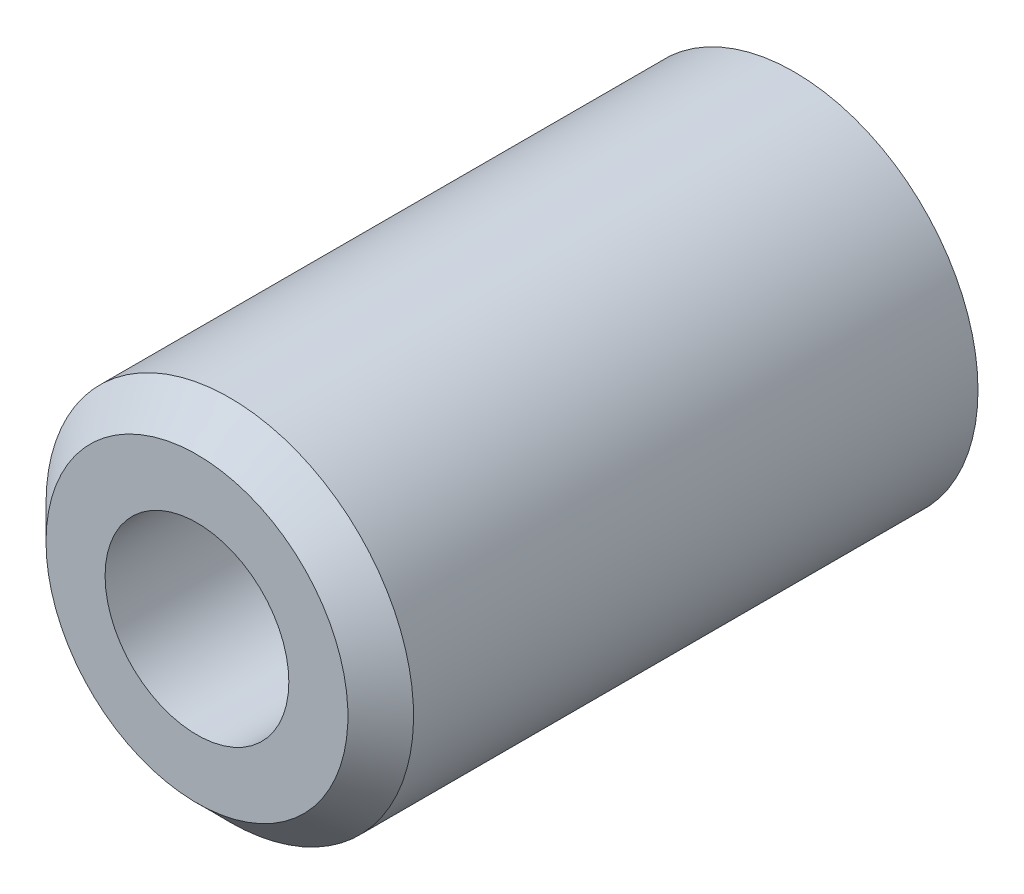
ISO-10303-21;
HEADER;
FILE_DESCRIPTION(('STEP AP214'),'2;1');
FILE_NAME('part.step','',(''),(''),'','','');
FILE_SCHEMA(('AUTOMOTIVE_DESIGN { 1 0 10303 214 1 1 1 1 }'));
ENDSEC;
DATA;
#1=APPLICATION_CONTEXT('core data for automotive mechanical design processes');
#2=APPLICATION_PROTOCOL_DEFINITION('international standard','automotive_design',2000,#1);
#3=PRODUCT_CONTEXT('',#1,'mechanical');
#4=PRODUCT('Part','Part','',(#3));
#5=PRODUCT_RELATED_PRODUCT_CATEGORY('part','',(#4));
#6=PRODUCT_DEFINITION_FORMATION('','',#4);
#7=PRODUCT_DEFINITION_CONTEXT('part definition',#1,'design');
#8=PRODUCT_DEFINITION('design','',#6,#7);
#9=PRODUCT_DEFINITION_SHAPE('','',#8);
#10=(LENGTH_UNIT() NAMED_UNIT(*) SI_UNIT(.MILLI.,.METRE.));
#11=(NAMED_UNIT(*) PLANE_ANGLE_UNIT() SI_UNIT($,.RADIAN.));
#12=(NAMED_UNIT(*) SI_UNIT($,.STERADIAN.) SOLID_ANGLE_UNIT());
#13=UNCERTAINTY_MEASURE_WITH_UNIT(LENGTH_MEASURE(1.E-05),#10,'distance_accuracy_value','');
#14=(GEOMETRIC_REPRESENTATION_CONTEXT(3) GLOBAL_UNCERTAINTY_ASSIGNED_CONTEXT((#13)) GLOBAL_UNIT_ASSIGNED_CONTEXT((#10,
#11,#12)) REPRESENTATION_CONTEXT('',''));
#15=CARTESIAN_POINT('',(0.,0.,0.));
#16=DIRECTION('',(0.,0.,1.));
#17=DIRECTION('',(1.,0.,0.));
#18=AXIS2_PLACEMENT_3D('',#15,#16,#17);
#19=CARTESIAN_POINT('',(0.,0.,64.));
#20=DIRECTION('',(0.,0.,-1.));
#21=DIRECTION('',(-1.,0.,0.));
#22=AXIS2_PLACEMENT_3D('',#19,#20,#21);
#23=CYLINDRICAL_SURFACE('',#22,14.0000000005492);
#24=CARTESIAN_POINT('',(0.,0.,64.));
#25=DIRECTION('',(0.,0.,-1.));
#26=DIRECTION('',(0.707106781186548,0.707106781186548,0.));
#27=AXIS2_PLACEMENT_3D('',#24,#25,#26);
#28=CIRCLE('',#27,14.0000000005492);
#29=CARTESIAN_POINT('',(9.89949493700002,9.89949493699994,64.));
#30=VERTEX_POINT('',#29);
#31=EDGE_CURVE('E33',#30,#30,#28,.T.);
#32=ORIENTED_EDGE('',*,*,#31,.T.);
#33=EDGE_LOOP('',(#32));
#34=FACE_BOUND('',#33,.T.);
#35=CARTESIAN_POINT('',(0.,0.,21.));
#36=DIRECTION('',(0.,0.,1.));
#37=DIRECTION('',(0.,-1.,0.));
#38=AXIS2_PLACEMENT_3D('',#35,#36,#37);
#39=CIRCLE('',#38,14.0000000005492);
#40=CARTESIAN_POINT('',(0.,-14.0000000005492,21.));
#41=VERTEX_POINT('',#40);
#42=EDGE_CURVE('E67',#41,#41,#39,.T.);
#43=ORIENTED_EDGE('',*,*,#42,.T.);
#44=EDGE_LOOP('',(#43));
#45=FACE_BOUND('',#44,.T.);
#46=ADVANCED_FACE('F12',(#34,#45),#23,.T.);
#47=CARTESIAN_POINT('',(0.,0.,66.5));
#48=DIRECTION('',(0.,0.,-1.));
#49=DIRECTION('',(-1.,0.,0.));
#50=AXIS2_PLACEMENT_3D('',#47,#48,#49);
#51=CONICAL_SURFACE('',#50,11.5000000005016,0.785398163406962);
#52=ORIENTED_EDGE('',*,*,#31,.F.);
#53=EDGE_LOOP('',(#52));
#54=FACE_BOUND('',#53,.T.);
#55=CARTESIAN_POINT('',(0.,0.,66.5));
#56=DIRECTION('',(0.,0.,-1.));
#57=DIRECTION('',(-1.,0.,0.));
#58=AXIS2_PLACEMENT_3D('',#55,#56,#57);
#59=CIRCLE('',#58,11.5000000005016);
#60=CARTESIAN_POINT('',(-11.5000000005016,0.,66.5));
#61=VERTEX_POINT('',#60);
#62=EDGE_CURVE('E16',#61,#61,#59,.T.);
#63=ORIENTED_EDGE('',*,*,#62,.T.);
#64=EDGE_LOOP('',(#63));
#65=FACE_BOUND('',#64,.T.);
#66=ADVANCED_FACE('F49',(#54,#65),#51,.T.);
#67=CARTESIAN_POINT('',(-16.458617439,0.,66.5));
#68=DIRECTION('',(0.,0.,-1.));
#69=DIRECTION('',(0.707106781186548,0.707106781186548,0.));
#70=AXIS2_PLACEMENT_3D('',#67,#68,#69);
#71=PLANE('',#70);
#72=CARTESIAN_POINT('',(0.,0.,66.5));
#73=DIRECTION('',(0.,0.,-1.));
#74=DIRECTION('',(-1.,0.,0.));
#75=AXIS2_PLACEMENT_3D('',#72,#73,#74);
#76=CIRCLE('',#75,6.99999999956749);
#77=CARTESIAN_POINT('',(-6.99999999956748,0.,66.5));
#78=VERTEX_POINT('',#77);
#79=EDGE_CURVE('E62',#78,#78,#76,.F.);
#80=ORIENTED_EDGE('',*,*,#79,.F.);
#81=EDGE_LOOP('',(#80));
#82=FACE_BOUND('',#81,.T.);
#83=ORIENTED_EDGE('',*,*,#62,.F.);
#84=EDGE_LOOP('',(#83));
#85=FACE_BOUND('',#84,.T.);
#86=ADVANCED_FACE('F46',(#82,#85),#71,.F.);
#87=CARTESIAN_POINT('',(0.,20.0365777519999,21.));
#88=DIRECTION('',(0.,0.,1.));
#89=DIRECTION('',(-0.707106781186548,-0.707106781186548,0.));
#90=AXIS2_PLACEMENT_3D('',#87,#88,#89);
#91=PLANE('',#90);
#92=CARTESIAN_POINT('',(0.,0.,21.));
#93=DIRECTION('',(0.,0.,-1.));
#94=DIRECTION('',(-1.,0.,0.));
#95=AXIS2_PLACEMENT_3D('',#92,#93,#94);
#96=CIRCLE('',#95,6.99999999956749);
#97=CARTESIAN_POINT('',(-6.99999999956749,0.,21.));
#98=VERTEX_POINT('',#97);
#99=EDGE_CURVE('E25',#98,#98,#96,.T.);
#100=ORIENTED_EDGE('',*,*,#99,.F.);
#101=EDGE_LOOP('',(#100));
#102=FACE_BOUND('',#101,.T.);
#103=ORIENTED_EDGE('',*,*,#42,.F.);
#104=EDGE_LOOP('',(#103));
#105=FACE_BOUND('',#104,.T.);
#106=ADVANCED_FACE('F14',(#102,#105),#91,.F.);
#107=CARTESIAN_POINT('',(0.,0.,66.5));
#108=DIRECTION('',(0.,0.,-1.));
#109=DIRECTION('',(-1.,0.,0.));
#110=AXIS2_PLACEMENT_3D('',#107,#108,#109);
#111=CYLINDRICAL_SURFACE('',#110,6.99999999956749);
#112=ORIENTED_EDGE('',*,*,#79,.T.);
#113=EDGE_LOOP('',(#112));
#114=FACE_BOUND('',#113,.T.);
#115=ORIENTED_EDGE('',*,*,#99,.T.);
#116=EDGE_LOOP('',(#115));
#117=FACE_BOUND('',#116,.T.);
#118=CARTESIAN_POINT('',(6.06217760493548,-3.50000038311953,34.5000000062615));
#119=CARTESIAN_POINT('',(6.062174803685,-3.50000263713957,34.408699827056));
#120=CARTESIAN_POINT('',(6.06424565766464,-3.49642505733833,34.317421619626));
#121=CARTESIAN_POINT('',(6.07244251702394,-3.48217079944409,34.1355769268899));
#122=CARTESIAN_POINT('',(6.07856941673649,-3.47149255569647,34.0450106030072));
#123=CARTESIAN_POINT('',(6.09466065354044,-3.44316359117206,33.8652458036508));
#124=CARTESIAN_POINT('',(6.10462819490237,-3.42550704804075,33.7760485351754));
#125=CARTESIAN_POINT('',(6.12803887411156,-3.38344708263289,33.5997118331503));
#126=CARTESIAN_POINT('',(6.14148348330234,-3.35904080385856,33.5125732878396));
#127=CARTESIAN_POINT('',(6.18621679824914,-3.27637938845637,33.2560375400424));
#128=CARTESIAN_POINT('',(6.22201272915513,-3.20850375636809,33.0904168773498));
#129=CARTESIAN_POINT('',(6.30148683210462,-3.04944788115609,32.7730161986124));
#130=CARTESIAN_POINT('',(6.34516689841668,-2.95826203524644,32.6212395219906));
#131=CARTESIAN_POINT('',(6.43989086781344,-2.74633061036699,32.3219343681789));
#132=CARTESIAN_POINT('',(6.49124497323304,-2.62376849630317,32.1757863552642));
#133=CARTESIAN_POINT('',(6.59301999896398,-2.35639316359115,31.9050673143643));
#134=CARTESIAN_POINT('',(6.64344047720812,-2.21156969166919,31.7805062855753));
#135=CARTESIAN_POINT('',(6.74175639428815,-1.89167355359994,31.5482014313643));
#136=CARTESIAN_POINT('',(6.78925236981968,-1.71521972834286,31.44215775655));
#137=CARTESIAN_POINT('',(6.85154149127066,-1.4371772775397,31.3070085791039));
#138=CARTESIAN_POINT('',(6.87081764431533,-1.34223112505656,31.2659339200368));
#139=CARTESIAN_POINT('',(6.90583508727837,-1.1485196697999,31.1921878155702));
#140=CARTESIAN_POINT('',(6.92157836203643,-1.04975654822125,31.1595116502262));
#141=CARTESIAN_POINT('',(6.94806560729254,-0.85629334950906,31.1049825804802));
#142=CARTESIAN_POINT('',(6.95908439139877,-0.761799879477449,31.0825276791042));
#143=CARTESIAN_POINT('',(6.97733373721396,-0.570960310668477,31.045517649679));
#144=CARTESIAN_POINT('',(6.9845661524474,-0.474615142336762,31.0309586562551));
#145=CARTESIAN_POINT('',(6.99503582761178,-0.280850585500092,31.0099262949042));
#146=CARTESIAN_POINT('',(6.99827421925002,-0.183431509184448,31.0034506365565));
#147=CARTESIAN_POINT('',(7.00067156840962,0.0116269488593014,30.9986572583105));
#148=CARTESIAN_POINT('',(6.99983077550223,0.109266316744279,31.0003390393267));
#149=CARTESIAN_POINT('',(6.99169221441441,0.384295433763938,31.0166246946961));
#150=CARTESIAN_POINT('',(6.97964404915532,0.561093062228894,31.0407359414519));
#151=CARTESIAN_POINT('',(6.94310174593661,0.907630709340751,31.1150795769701));
#152=CARTESIAN_POINT('',(6.91860672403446,1.07737022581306,31.165313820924));
#153=CARTESIAN_POINT('',(6.85900424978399,1.40807562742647,31.2907901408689));
#154=CARTESIAN_POINT('',(6.82375455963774,1.56888749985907,31.3663688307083));
#155=CARTESIAN_POINT('',(6.74581720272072,1.87592340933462,31.5399222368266));
#156=CARTESIAN_POINT('',(6.70312699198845,2.022142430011,31.6379046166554));
#157=CARTESIAN_POINT('',(6.60955772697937,2.31059469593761,31.8641257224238));
#158=CARTESIAN_POINT('',(6.55828606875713,2.45114744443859,31.9943479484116));
#159=CARTESIAN_POINT('',(6.45591207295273,2.70934156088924,32.276025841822));
#160=CARTESIAN_POINT('',(6.40480994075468,2.82696118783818,32.4275014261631));
#161=CARTESIAN_POINT('',(6.30501071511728,3.0433469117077,32.7594117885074));
#162=CARTESIAN_POINT('',(6.25667714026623,3.14042354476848,32.9410798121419));
#163=CARTESIAN_POINT('',(6.19395474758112,3.26143880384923,33.2257661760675));
#164=CARTESIAN_POINT('',(6.17468308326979,3.29766705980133,33.3226484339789));
#165=CARTESIAN_POINT('',(6.1401334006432,3.36155924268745,33.519872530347));
#166=CARTESIAN_POINT('',(6.12485362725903,3.38922693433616,33.6202128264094));
#167=CARTESIAN_POINT('',(6.09576150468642,3.44133789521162,33.8487551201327));
#168=CARTESIAN_POINT('',(6.08324955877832,3.46328598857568,33.9777034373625));
#169=CARTESIAN_POINT('',(6.06646033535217,3.49261434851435,34.2377831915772));
#170=CARTESIAN_POINT('',(6.06218162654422,3.49999714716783,34.3689142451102));
#171=CARTESIAN_POINT('',(6.06217480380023,3.50000263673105,34.5913001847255));
#172=CARTESIAN_POINT('',(6.06424565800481,3.4964250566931,34.6825783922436));
#173=CARTESIAN_POINT('',(6.07244251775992,3.48217079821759,34.8644230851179));
#174=CARTESIAN_POINT('',(6.07856941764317,3.47149255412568,34.954989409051));
#175=CARTESIAN_POINT('',(6.09466065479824,3.44316358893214,35.1347542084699));
#176=CARTESIAN_POINT('',(6.10462819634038,3.42550704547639,35.2239514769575));
#177=CARTESIAN_POINT('',(6.12803887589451,3.38344707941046,35.4002881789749));
#178=CARTESIAN_POINT('',(6.14148348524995,3.35904080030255,35.4874267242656));
#179=CARTESIAN_POINT('',(6.18621680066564,3.27637938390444,35.7439624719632));
#180=CARTESIAN_POINT('',(6.22201273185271,3.20850375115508,35.909583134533));
#181=CARTESIAN_POINT('',(6.30148683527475,3.04944787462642,36.226983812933));
#182=CARTESIAN_POINT('',(6.34516690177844,2.95826202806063,36.3787604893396));
#183=CARTESIAN_POINT('',(6.43989087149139,2.74633060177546,36.6780656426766));
#184=CARTESIAN_POINT('',(6.49124497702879,2.62376848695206,36.824213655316));
#185=CARTESIAN_POINT('',(6.59302000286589,2.3563931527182,37.0949326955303));
#186=CARTESIAN_POINT('',(6.64344048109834,2.21156968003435,37.2194937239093));
#187=CARTESIAN_POINT('',(6.74175639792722,1.89167354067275,37.4517985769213));
#188=CARTESIAN_POINT('',(6.7892523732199,1.71521971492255,37.5578422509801));
#189=CARTESIAN_POINT('',(6.85154149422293,1.43717726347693,37.6929914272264));
#190=CARTESIAN_POINT('',(6.87081764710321,1.34223111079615,37.7340660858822));
#191=CARTESIAN_POINT('',(6.90583508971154,1.14851965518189,37.8078121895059));
#192=CARTESIAN_POINT('',(6.9215783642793,1.04975653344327,37.8404883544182));
#193=CARTESIAN_POINT('',(6.94806560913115,0.85629333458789,37.8950174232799));
#194=CARTESIAN_POINT('',(6.95908439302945,0.76179986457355,37.9174723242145));
#195=CARTESIAN_POINT('',(6.97733373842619,0.570960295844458,37.9544823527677));
#196=CARTESIAN_POINT('',(6.98456615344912,0.474615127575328,37.9690413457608));
#197=CARTESIAN_POINT('',(6.99503582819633,0.280850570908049,37.9900737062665));
#198=CARTESIAN_POINT('',(6.99827421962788,0.18343149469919,37.9965493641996));
#199=CARTESIAN_POINT('',(7.00067156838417,-0.0116269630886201,38.0013427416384));
#200=CARTESIAN_POINT('',(6.99983077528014,-0.109266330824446,37.9996609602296));
#201=CARTESIAN_POINT('',(6.99169221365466,-0.384295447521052,37.9833753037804));
#202=CARTESIAN_POINT('',(6.9796440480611,-0.561093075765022,37.9592640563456));
#203=CARTESIAN_POINT('',(6.94310174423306,-0.907630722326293,37.884920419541));
#204=CARTESIAN_POINT('',(6.91860672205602,-1.07737023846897,37.8346861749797));
#205=CARTESIAN_POINT('',(6.85900424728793,-1.40807563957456,37.7092098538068));
#206=CARTESIAN_POINT('',(6.82375455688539,-1.56888751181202,37.6336311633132));
#207=CARTESIAN_POINT('',(6.74581719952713,-1.87592342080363,37.4600777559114));
#208=CARTESIAN_POINT('',(6.70312698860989,-2.02214244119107,37.3620953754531));
#209=CARTESIAN_POINT('',(6.60955772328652,-2.3105947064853,37.1358742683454));
#210=CARTESIAN_POINT('',(6.55828606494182,-2.45114745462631,37.0056520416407));
#211=CARTESIAN_POINT('',(6.45591206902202,-2.70934157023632,36.7239741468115));
#212=CARTESIAN_POINT('',(6.40480993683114,-2.82696119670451,36.5724985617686));
#213=CARTESIAN_POINT('',(6.30501071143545,-3.04334691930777,36.2405881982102));
#214=CARTESIAN_POINT('',(6.25667713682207,-3.14042355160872,36.0589201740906));
#215=CARTESIAN_POINT('',(6.19395474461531,-3.26143880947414,35.7742338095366));
#216=CARTESIAN_POINT('',(6.17468308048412,-3.29766706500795,35.6773515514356));
#217=CARTESIAN_POINT('',(6.14013339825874,-3.36155924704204,35.4801274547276));
#218=CARTESIAN_POINT('',(6.12485362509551,-3.38922693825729,35.3797871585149));
#219=CARTESIAN_POINT('',(6.09576150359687,-3.4413378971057,35.151244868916));
#220=CARTESIAN_POINT('',(6.08324955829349,-3.46328598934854,35.0222965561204));
#221=CARTESIAN_POINT('',(6.06646033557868,-3.49261434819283,34.7622168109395));
#222=CARTESIAN_POINT('',(6.0621816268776,-3.49999714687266,34.6310857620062));
#223=CARTESIAN_POINT('',(6.06217760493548,-3.50000038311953,34.5000000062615));
#224=B_SPLINE_CURVE_WITH_KNOTS('',3,(#118,#119,#120,#121,#122,#123,#124,#125,#126,#127,#128,
#129,#130,#131,#132,#133,#134,#135,#136,#137,#138,#139,#140,#141,#142,#143,#144,#145,#146,#147,
#148,#149,#150,#151,#152,#153,#154,#155,#156,#157,#158,#159,#160,#161,#162,#163,#164,#165,#166,
#167,#168,#169,#170,#171,#172,#173,#174,#175,#176,#177,#178,#179,#180,#181,#182,#183,#184,#185,
#186,#187,#188,#189,#190,#191,#192,#193,#194,#195,#196,#197,#198,#199,#200,#201,#202,#203,#204,
#205,#206,#207,#208,#209,#210,#211,#212,#213,#214,#215,#216,#217,#218,#219,#220,#221,#222,#223),
.UNSPECIFIED.,.T.,.F.,(4,2,2,2,2,2,2,2,2,2,2,2,2,2,2,2,2,2,2,2,2,2,2,2,2,2,2,2,2,2,2,2,2,2,2,2,
2,2,2,2,2,2,2,2,2,2,2,2,2,2,2,2,4),(0.,0.273769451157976,0.547599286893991,0.821658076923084,
1.0958330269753,1.64085722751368,2.18601255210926,2.77608654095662,3.36643312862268,
3.99658348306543,4.31189690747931,4.62703273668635,4.91988216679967,5.21258810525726,
5.50521108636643,5.79781616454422,6.33156981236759,6.86536137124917,7.40654348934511,
7.94791100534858,8.54040467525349,9.13345733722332,9.76448404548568,10.0797285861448,
10.3948342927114,10.7879717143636,11.1810407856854,11.4548102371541,11.7286400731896,
12.0026988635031,12.2768738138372,12.8218980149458,13.3670533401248,13.9571273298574,
14.5474739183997,15.1776242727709,15.4929376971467,15.8080735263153,16.100922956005,
16.3936288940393,16.6862518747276,16.9788569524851,17.512610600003,18.0464021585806,
18.587584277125,19.1289517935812,19.7214454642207,20.3144981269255,20.9455248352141,
21.2607693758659,21.5758750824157,21.9690124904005,22.3620815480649),.UNSPECIFIED.);
#225=CARTESIAN_POINT('',(6.06217760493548,-3.50000038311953,34.5000000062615));
#226=VERTEX_POINT('',#225);
#227=EDGE_CURVE('E8',#226,#226,#224,.T.);
#228=ORIENTED_EDGE('',*,*,#227,.T.);
#229=EDGE_LOOP('',(#228));
#230=FACE_BOUND('',#229,.T.);
#231=CARTESIAN_POINT('',(-6.06217760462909,3.50000038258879,34.5000000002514));
#232=CARTESIAN_POINT('',(-6.06217480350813,3.50000263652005,34.4086998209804));
#233=CARTESIAN_POINT('',(-6.06424565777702,3.49642505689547,34.3174216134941));
#234=CARTESIAN_POINT('',(-6.07244251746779,3.48217079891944,34.1355769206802));
#235=CARTESIAN_POINT('',(-6.07856941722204,3.47149255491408,34.0450105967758));
#236=CARTESIAN_POINT('',(-6.09466065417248,3.4431635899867,33.8652457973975));
#237=CARTESIAN_POINT('',(-6.10462819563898,3.42550704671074,33.7760485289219));
#238=CARTESIAN_POINT('',(-6.12803887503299,3.38344708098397,33.5997118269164));
#239=CARTESIAN_POINT('',(-6.14148348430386,3.35904080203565,33.5125732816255));
#240=CARTESIAN_POINT('',(-6.18621679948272,3.2763793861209,33.2560375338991));
#241=CARTESIAN_POINT('',(-6.22201273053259,3.20850375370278,33.0904168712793));
#242=CARTESIAN_POINT('',(-6.30148683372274,3.04944787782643,32.7730161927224));
#243=CARTESIAN_POINT('',(-6.34516690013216,2.95826203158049,32.6212395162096));
#244=CARTESIAN_POINT('',(-6.4398908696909,2.74633060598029,32.3219343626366));
#245=CARTESIAN_POINT('',(-6.49124497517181,2.62376849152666,32.1757863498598));
#246=CARTESIAN_POINT('',(-6.59302000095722,2.35639315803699,31.9050673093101));
#247=CARTESIAN_POINT('',(-6.64344047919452,2.21156968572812,31.7805062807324));
#248=CARTESIAN_POINT('',(-6.74175639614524,1.89167354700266,31.5482014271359));
#249=CARTESIAN_POINT('',(-6.78925237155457,1.71521972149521,31.4421577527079));
#250=CARTESIAN_POINT('',(-6.85154149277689,1.43717727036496,31.3070085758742));
#251=CARTESIAN_POINT('',(-6.87081764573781,1.34223111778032,31.2659339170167));
#252=CARTESIAN_POINT('',(-6.9058350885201,1.14851966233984,31.1921878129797));
#253=CARTESIAN_POINT('',(-6.92157836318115,1.04975654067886,31.1595116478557));
#254=CARTESIAN_POINT('',(-6.94806560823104,0.856293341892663,31.1049825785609));
#255=CARTESIAN_POINT('',(-6.95908439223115,0.761799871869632,31.0825276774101));
#256=CARTESIAN_POINT('',(-6.97733373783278,0.570960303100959,31.04551764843));
#257=CARTESIAN_POINT('',(-6.98456615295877,0.474615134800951,31.0309586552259));
#258=CARTESIAN_POINT('',(-6.99503582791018,0.280850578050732,31.0099262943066));
#259=CARTESIAN_POINT('',(-6.9982742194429,0.183431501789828,31.0034506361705));
#260=CARTESIAN_POINT('',(-7.00067156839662,-0.0116269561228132,30.9986572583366));
#261=CARTESIAN_POINT('',(-6.99983077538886,-0.109266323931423,31.0003390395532));
#262=CARTESIAN_POINT('',(-6.99169221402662,-0.384295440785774,31.0166246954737));
#263=CARTESIAN_POINT('',(-6.97964404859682,-0.561093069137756,31.0407359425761));
#264=CARTESIAN_POINT('',(-6.94310174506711,-0.907630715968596,31.1150795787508));
#265=CARTESIAN_POINT('',(-6.91860672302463,-1.07737023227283,31.1653138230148));
#266=CARTESIAN_POINT('',(-6.85900424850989,-1.40807563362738,31.2907901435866));
#267=CARTESIAN_POINT('',(-6.82375455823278,-1.56888750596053,31.36636883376));
#268=CARTESIAN_POINT('',(-6.74581720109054,-1.87592341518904,31.5399222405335));
#269=CARTESIAN_POINT('',(-6.7031269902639,-2.02214243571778,31.6379046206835));
#270=CARTESIAN_POINT('',(-6.60955772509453,-2.31059470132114,31.8641257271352));
#271=CARTESIAN_POINT('',(-6.55828606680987,-2.45114744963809,31.9943479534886));
#272=CARTESIAN_POINT('',(-6.45591207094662,-2.70934156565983,32.2760258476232));
#273=CARTESIAN_POINT('',(-6.4048099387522,-2.82696119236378,32.4275014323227));
#274=CARTESIAN_POINT('',(-6.30501071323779,-3.04334691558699,32.7594117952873));
#275=CARTESIAN_POINT('',(-6.25667713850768,-3.14042354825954,32.9410798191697));
#276=CARTESIAN_POINT('',(-6.1939547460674,-3.26143880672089,33.225766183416));
#277=CARTESIAN_POINT('',(-6.17468308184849,-3.29766706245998,33.3226484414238));
#278=CARTESIAN_POINT('',(-6.14013339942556,-3.36155924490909,33.519872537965));
#279=CARTESIAN_POINT('',(-6.12485362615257,-3.3892269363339,33.6202128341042));
#280=CARTESIAN_POINT('',(-6.09576150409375,-3.44133789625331,33.8487551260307));
#281=CARTESIAN_POINT('',(-6.08324955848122,-3.46328598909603,33.9777034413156));
#282=CARTESIAN_POINT('',(-6.06646033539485,-3.4926143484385,34.2377831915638));
#283=CARTESIAN_POINT('',(-6.06218162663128,-3.4999971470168,34.3689142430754));
#284=CARTESIAN_POINT('',(-6.06217480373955,-3.50000263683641,34.5913001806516));
#285=CARTESIAN_POINT('',(-6.06424565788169,-3.49642505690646,34.6825783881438));
#286=CARTESIAN_POINT('',(-6.07244251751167,-3.48217079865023,34.8644230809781));
#287=CARTESIAN_POINT('',(-6.07856941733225,-3.47149255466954,34.954989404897));
#288=CARTESIAN_POINT('',(-6.09466065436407,-3.44316358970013,35.1347542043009));
#289=CARTESIAN_POINT('',(-6.1046281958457,-3.42550704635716,35.2239514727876));
#290=CARTESIAN_POINT('',(-6.12803887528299,-3.38344708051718,35.4002881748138));
#291=CARTESIAN_POINT('',(-6.14148348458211,-3.35904080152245,35.4874267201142));
#292=CARTESIAN_POINT('',(-6.18621679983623,-3.27637938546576,35.7439624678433));
#293=CARTESIAN_POINT('',(-6.22201273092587,-3.20850375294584,35.9095831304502));
#294=CARTESIAN_POINT('',(-6.30148683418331,-3.04944787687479,36.2269838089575));
#295=CARTESIAN_POINT('',(-6.3451669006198,-2.95826203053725,36.3787604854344));
#296=CARTESIAN_POINT('',(-6.43989087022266,-2.74633060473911,36.6780656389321));
#297=CARTESIAN_POINT('',(-6.49124497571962,-2.62376849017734,36.8242136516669));
#298=CARTESIAN_POINT('',(-6.59302000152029,-2.35639315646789,37.094932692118));
#299=CARTESIAN_POINT('',(-6.64344047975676,-2.21156968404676,37.2194937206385));
#300=CARTESIAN_POINT('',(-6.74175639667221,-1.89167354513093,37.4517985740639));
#301=CARTESIAN_POINT('',(-6.78925237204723,-1.71521971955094,37.5578422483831));
#302=CARTESIAN_POINT('',(-6.85154149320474,-1.43717726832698,37.6929914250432));
#303=CARTESIAN_POINT('',(-6.87081764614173,-1.34223111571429,37.7340660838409));
#304=CARTESIAN_POINT('',(-6.90583508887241,-1.1485196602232,37.8078121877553));
#305=CARTESIAN_POINT('',(-6.92157836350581,-1.04975653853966,37.8404883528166));
#306=CARTESIAN_POINT('',(-6.94806560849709,-0.856293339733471,37.8950174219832));
#307=CARTESIAN_POINT('',(-6.95908439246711,-0.761799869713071,37.9174723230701));
#308=CARTESIAN_POINT('',(-6.97733373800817,-0.570960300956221,37.954482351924));
#309=CARTESIAN_POINT('',(-6.9845661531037,-0.474615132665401,37.9690413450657));
#310=CARTESIAN_POINT('',(-6.99503582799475,-0.280850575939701,37.9900737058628));
#311=CARTESIAN_POINT('',(-6.99827421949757,-0.183431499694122,37.9965493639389));
#312=CARTESIAN_POINT('',(-7.00067156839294,0.0116269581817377,38.001342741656));
#313=CARTESIAN_POINT('',(-6.99983077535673,0.109266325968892,37.9996609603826));
#314=CARTESIAN_POINT('',(-6.99169221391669,0.384295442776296,37.9833753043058));
#315=CARTESIAN_POINT('',(-6.97964404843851,0.561093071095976,37.9592640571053));
#316=CARTESIAN_POINT('',(-6.94310174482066,0.907630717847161,37.8849204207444));
#317=CARTESIAN_POINT('',(-6.91860672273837,1.07737023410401,37.8346861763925));
#318=CARTESIAN_POINT('',(-6.85900424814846,1.40807563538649,37.7092098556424));
#319=CARTESIAN_POINT('',(-6.82375455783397,1.56888750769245,37.6336311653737));
#320=CARTESIAN_POINT('',(-6.74581720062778,1.87592341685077,37.4600777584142));
#321=CARTESIAN_POINT('',(-6.70312698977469,2.0221424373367,37.3620953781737));
#322=CARTESIAN_POINT('',(-6.60955772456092,2.31059470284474,37.135874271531));
#323=CARTESIAN_POINT('',(-6.55828606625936,2.45114745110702,37.0056520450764));
#324=CARTESIAN_POINT('',(-6.45591207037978,2.70934156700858,36.7239741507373));
#325=CARTESIAN_POINT('',(-6.40480993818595,2.82696119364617,36.5724985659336));
#326=CARTESIAN_POINT('',(-6.30501071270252,3.04334691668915,36.2405882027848));
#327=CARTESIAN_POINT('',(-6.25667713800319,3.14042354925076,36.0589201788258));
#328=CARTESIAN_POINT('',(-6.19395474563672,3.26143880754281,35.7742338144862));
#329=CARTESIAN_POINT('',(-6.17468308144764,3.29766706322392,35.6773515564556));
#330=CARTESIAN_POINT('',(-6.14013339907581,3.36155924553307,35.4801274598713));
#331=CARTESIAN_POINT('',(-6.12485362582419,3.38922693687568,35.3797871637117));
#332=CARTESIAN_POINT('',(-6.09576150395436,3.44133789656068,35.1512448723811));
#333=CARTESIAN_POINT('',(-6.08324955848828,3.46328598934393,35.0222965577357));
#334=CARTESIAN_POINT('',(-6.06646033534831,3.49261434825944,34.7622168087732));
#335=CARTESIAN_POINT('',(-6.0621816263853,3.49999714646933,34.6310857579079));
#336=CARTESIAN_POINT('',(-6.06217760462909,3.50000038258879,34.5000000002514));
#337=B_SPLINE_CURVE_WITH_KNOTS('',3,(#231,#232,#233,#234,#235,#236,#237,#238,#239,#240,#241,
#242,#243,#244,#245,#246,#247,#248,#249,#250,#251,#252,#253,#254,#255,#256,#257,#258,#259,#260,
#261,#262,#263,#264,#265,#266,#267,#268,#269,#270,#271,#272,#273,#274,#275,#276,#277,#278,#279,
#280,#281,#282,#283,#284,#285,#286,#287,#288,#289,#290,#291,#292,#293,#294,#295,#296,#297,#298,
#299,#300,#301,#302,#303,#304,#305,#306,#307,#308,#309,#310,#311,#312,#313,#314,#315,#316,#317,
#318,#319,#320,#321,#322,#323,#324,#325,#326,#327,#328,#329,#330,#331,#332,#333,#334,#335,#336),
.UNSPECIFIED.,.T.,.F.,(4,2,2,2,2,2,2,2,2,2,2,2,2,2,2,2,2,2,2,2,2,2,2,2,2,2,2,2,2,2,2,2,2,2,2,2,
2,2,2,2,2,2,2,2,2,2,2,2,2,2,2,2,4),(0.,0.273769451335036,0.547599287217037,0.821658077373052,
1.09583302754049,1.64085722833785,2.18601255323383,2.77608654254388,3.36643313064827,
3.99658348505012,4.31189690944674,4.62703273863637,4.91988216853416,5.2125881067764,
5.50521108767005,5.79781616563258,6.33156981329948,6.86536137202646,7.40654349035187,
7.94791100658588,8.54040467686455,9.13345733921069,9.76448404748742,10.0797285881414,
10.3948342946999,10.7879717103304,11.1810407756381,11.4548102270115,11.7286400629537,
12.0026988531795,12.2768738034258,12.821898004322,13.3670533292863,13.9571273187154,
14.5474739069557,15.177624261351,15.4929376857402,15.8080735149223,16.1009229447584,
16.393628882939,16.6862518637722,16.9788569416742,17.512610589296,18.04640214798,
18.5875842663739,19.1289517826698,19.7214454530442,20.3144981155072,20.9455248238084,
21.2607693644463,21.5758750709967,21.9690124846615,22.3620815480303),.UNSPECIFIED.);
#338=CARTESIAN_POINT('',(-6.06217760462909,3.50000038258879,34.5000000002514));
#339=VERTEX_POINT('',#338);
#340=EDGE_CURVE('E20',#339,#339,#337,.T.);
#341=ORIENTED_EDGE('',*,*,#340,.T.);
#342=EDGE_LOOP('',(#341));
#343=FACE_BOUND('',#342,.T.);
#344=ADVANCED_FACE('F39',(#114,#117,#230,#343),#111,.F.);
#345=CARTESIAN_POINT('',(7.08405705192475,0.,34.5));
#346=DIRECTION('',(-1.,0.,0.));
#347=DIRECTION('',(0.,0.,1.));
#348=AXIS2_PLACEMENT_3D('',#345,#346,#347);
#349=CYLINDRICAL_SURFACE('',#348,3.500000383);
#350=ORIENTED_EDGE('',*,*,#340,.F.);
#351=EDGE_LOOP('',(#350));
#352=FACE_BOUND('',#351,.T.);
#353=ORIENTED_EDGE('',*,*,#227,.F.);
#354=EDGE_LOOP('',(#353));
#355=FACE_BOUND('',#354,.T.);
#356=ADVANCED_FACE('F42',(#352,#355),#349,.T.);
#357=CLOSED_SHELL('',(#46,#66,#86,#106,#344,#356));
#358=MANIFOLD_SOLID_BREP('B1',#357);
#359=ADVANCED_BREP_SHAPE_REPRESENTATION('',(#18,#358),#14);
#360=SHAPE_DEFINITION_REPRESENTATION(#9,#359);
ENDSEC;
END-ISO-10303-21;
